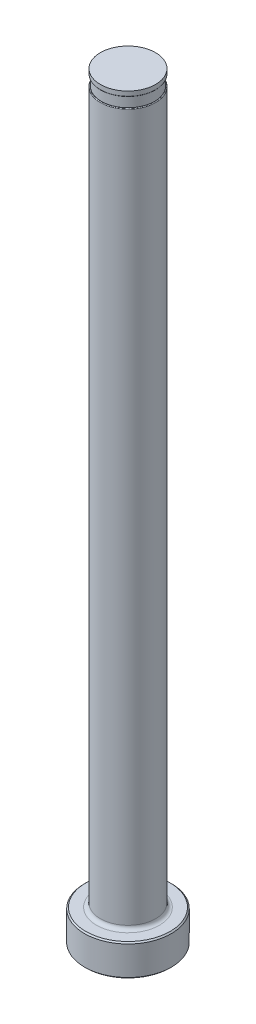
from build123d import *

# Parameters (mm, degrees)
CHAMFER1_SIZE     = 0.254
FILLET1_R         = 0.762
SKETCH2_W         = 0.2032
SKETCH2_H         = 2.032
D_SLOT_DEPTH      = 153.898684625
D_SLOT_DEPTH_BACK = 153.898684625
SKETCH5_W         = 0.00508
SKETCH5_H         = 1.016
FILLET2_R         = 0.127


with BuildPart() as part:
    # Sketch1 → Revolve1 (revolve)
    with BuildSketch(Plane.XY, mode=Mode.PRIVATE) as revolve1_sk:
        Polygon((0, 0), (-8.7249, 0), (-8.7249, 6.35), (-5.55625, 6.35), (-5.55625, 152.4), (0, 152.4), align=None)
    revolve(revolve1_sk.sketch.rotate(Axis((0, 259.958771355, 0), (0, -1, 0)), 270), axis=Axis((0, 259.958771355, 0), (0, -1, 0)))

    # Chamfer1
    chamfer1_edges = [part.edges().sort_by_distance(p)[0] for p in [
        (0, 6.35, -8.7249),
        (0, 0, -8.7249),
    ]]
    chamfer(chamfer1_edges, length=CHAMFER1_SIZE)

    # Fillet1
    fillet1_edges = [part.edges().sort_by_distance(p)[0] for p in [
        (0, 6.35, -5.55625),
    ]]
    fillet(fillet1_edges, radius=FILLET1_R)

    # Sketch2 → Vent Relief (revolve, cut)
    with BuildSketch(Plane.XY, mode=Mode.PRIVATE) as vent_relief_sk:
        with Locations((-5.45465, 150.368)):
            Rectangle(SKETCH2_W, SKETCH2_H)
    revolve(vent_relief_sk.sketch.rotate(Axis((0, 153.448281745, 0), (0, -1, 0)), 270), axis=Axis((0, 153.448281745, 0), (0, -1, 0)), mode=Mode.SUBTRACT)

    # Sketch3 → D-Slot (cut, two sides: drawn at the far end of the back side and taken through both)
    with BuildSketch(Plane.XY.offset(-D_SLOT_DEPTH_BACK)):
        with BuildLine():
            Line((-5.35305, 150.368), (-5.35305, 86.868))
            ThreePointArc((-5.35305, 86.868), (-5.404263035, 86.300038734), (-5.55625, 85.7504))
            Line((-5.55625, 85.7504), (-5.55625, 150.368))
            Line((-5.55625, 150.368), (-5.35305, 150.368))
        make_face()
    extrude(amount=D_SLOT_DEPTH + D_SLOT_DEPTH_BACK, mode=Mode.SUBTRACT)

    # Sketch5 → Vent Diameter (revolve, cut)
    with BuildSketch(Plane.XY, mode=Mode.PRIVATE) as vent_diameter_sk:
        with Locations((-5.55371, 151.892)):
            Rectangle(SKETCH5_W, SKETCH5_H)
    revolve(vent_diameter_sk.sketch.rotate(Axis((0, 152.687735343, 0), (0, -1, 0)), 90), axis=Axis((0, 152.687735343, 0), (0, -1, 0)), mode=Mode.SUBTRACT)

    # Fillet2
    fillet2_edges = [part.edges().sort_by_distance(p)[0] for p in [
        (4.424054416, 149.352, -3.361496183),
        (0, 151.384, 5.55117),
    ]]
    fillet(fillet2_edges, radius=FILLET2_R)


solid = part.part
